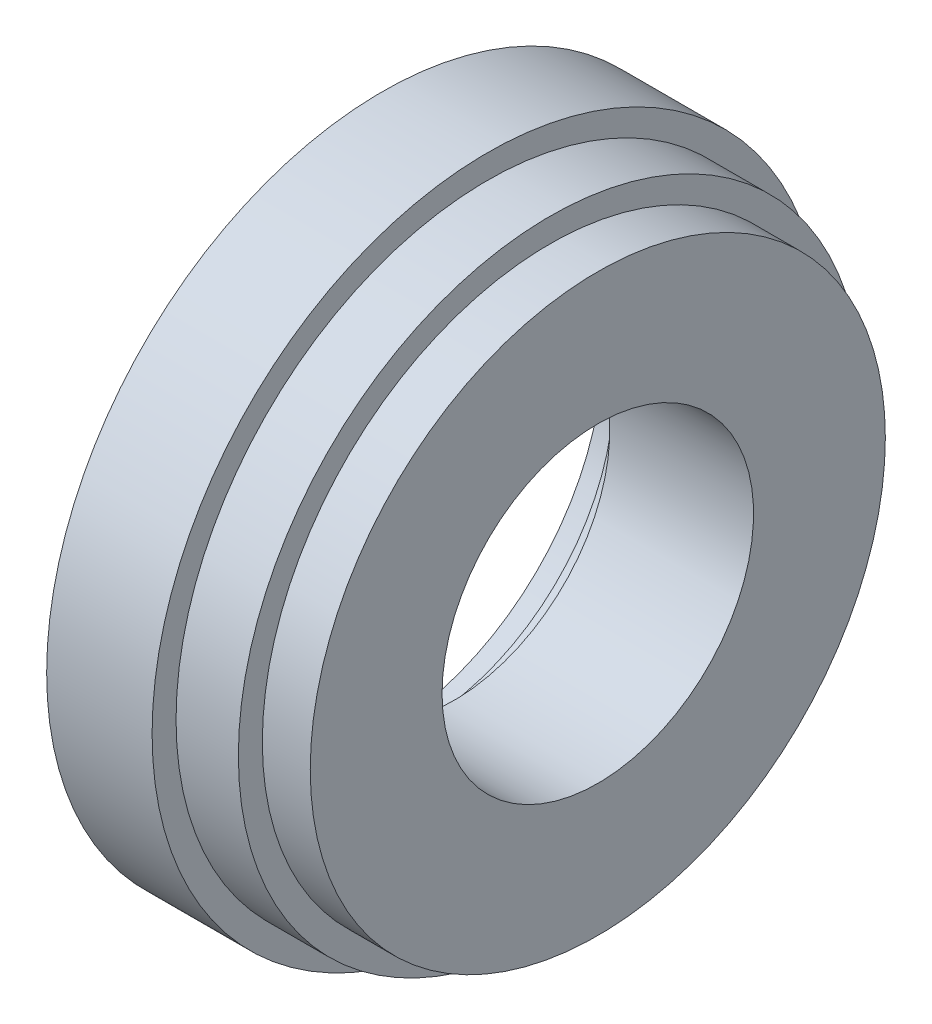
ISO-10303-21;
HEADER;
FILE_DESCRIPTION(('STEP AP214'),'2;1');
FILE_NAME('part.step','',(''),(''),'','','');
FILE_SCHEMA(('AUTOMOTIVE_DESIGN { 1 0 10303 214 1 1 1 1 }'));
ENDSEC;
DATA;
#1=APPLICATION_CONTEXT('core data for automotive mechanical design processes');
#2=APPLICATION_PROTOCOL_DEFINITION('international standard','automotive_design',2000,#1);
#3=PRODUCT_CONTEXT('',#1,'mechanical');
#4=PRODUCT('Part','Part','',(#3));
#5=PRODUCT_RELATED_PRODUCT_CATEGORY('part','',(#4));
#6=PRODUCT_DEFINITION_FORMATION('','',#4);
#7=PRODUCT_DEFINITION_CONTEXT('part definition',#1,'design');
#8=PRODUCT_DEFINITION('design','',#6,#7);
#9=PRODUCT_DEFINITION_SHAPE('','',#8);
#10=(LENGTH_UNIT() NAMED_UNIT(*) SI_UNIT(.MILLI.,.METRE.));
#11=(NAMED_UNIT(*) PLANE_ANGLE_UNIT() SI_UNIT($,.RADIAN.));
#12=(NAMED_UNIT(*) SI_UNIT($,.STERADIAN.) SOLID_ANGLE_UNIT());
#13=UNCERTAINTY_MEASURE_WITH_UNIT(LENGTH_MEASURE(1.E-05),#10,'distance_accuracy_value','');
#14=(GEOMETRIC_REPRESENTATION_CONTEXT(3) GLOBAL_UNCERTAINTY_ASSIGNED_CONTEXT((#13)) GLOBAL_UNIT_ASSIGNED_CONTEXT((#10,
#11,#12)) REPRESENTATION_CONTEXT('',''));
#15=CARTESIAN_POINT('',(0.,0.,0.));
#16=DIRECTION('',(0.,0.,1.));
#17=DIRECTION('',(1.,0.,0.));
#18=AXIS2_PLACEMENT_3D('',#15,#16,#17);
#19=CARTESIAN_POINT('',(-4.43492063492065,0.,0.));
#20=DIRECTION('',(-1.,0.,0.));
#21=DIRECTION('',(0.,0.,1.));
#22=AXIS2_PLACEMENT_3D('',#19,#20,#21);
#23=CYLINDRICAL_SURFACE('',#22,32.5);
#24=CARTESIAN_POINT('',(45.,0.,0.));
#25=DIRECTION('',(-1.,0.,0.));
#26=DIRECTION('',(0.,0.,1.));
#27=AXIS2_PLACEMENT_3D('',#24,#25,#26);
#28=CIRCLE('',#27,32.5);
#29=CARTESIAN_POINT('',(45.,0.,32.5));
#30=VERTEX_POINT('',#29);
#31=EDGE_CURVE('E69',#30,#30,#28,.T.);
#32=ORIENTED_EDGE('',*,*,#31,.F.);
#33=EDGE_LOOP('',(#32));
#34=FACE_BOUND('',#33,.T.);
#35=CARTESIAN_POINT('',(15.,0.,0.));
#36=DIRECTION('',(-1.,0.,0.));
#37=DIRECTION('',(0.,0.,1.));
#38=AXIS2_PLACEMENT_3D('',#35,#36,#37);
#39=CIRCLE('',#38,32.5);
#40=CARTESIAN_POINT('',(15.,0.,32.5));
#41=VERTEX_POINT('',#40);
#42=EDGE_CURVE('E10',#41,#41,#39,.T.);
#43=ORIENTED_EDGE('',*,*,#42,.T.);
#44=EDGE_LOOP('',(#43));
#45=FACE_BOUND('',#44,.T.);
#46=ADVANCED_FACE('F29',(#34,#45),#23,.F.);
#47=CARTESIAN_POINT('',(15.,40.,0.));
#48=DIRECTION('',(1.,0.,0.));
#49=DIRECTION('',(0.,0.,-1.));
#50=AXIS2_PLACEMENT_3D('',#47,#48,#49);
#51=PLANE('',#50);
#52=ORIENTED_EDGE('',*,*,#42,.F.);
#53=EDGE_LOOP('',(#52));
#54=FACE_BOUND('',#53,.T.);
#55=CARTESIAN_POINT('',(15.,0.,0.));
#56=DIRECTION('',(-1.,0.,0.));
#57=DIRECTION('',(0.,0.,1.));
#58=AXIS2_PLACEMENT_3D('',#55,#56,#57);
#59=CIRCLE('',#58,40.);
#60=CARTESIAN_POINT('',(15.,0.,40.));
#61=VERTEX_POINT('',#60);
#62=EDGE_CURVE('E35',#61,#61,#59,.T.);
#63=ORIENTED_EDGE('',*,*,#62,.T.);
#64=EDGE_LOOP('',(#63));
#65=FACE_BOUND('',#64,.T.);
#66=ADVANCED_FACE('F76',(#54,#65),#51,.F.);
#67=CARTESIAN_POINT('',(-4.43492063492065,0.,0.));
#68=DIRECTION('',(-1.,0.,0.));
#69=DIRECTION('',(0.,0.,1.));
#70=AXIS2_PLACEMENT_3D('',#67,#68,#69);
#71=CYLINDRICAL_SURFACE('',#70,40.);
#72=ORIENTED_EDGE('',*,*,#62,.F.);
#73=EDGE_LOOP('',(#72));
#74=FACE_BOUND('',#73,.T.);
#75=CARTESIAN_POINT('',(8.31547619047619,0.,0.));
#76=DIRECTION('',(-1.,0.,0.));
#77=DIRECTION('',(0.,0.,1.));
#78=AXIS2_PLACEMENT_3D('',#75,#76,#77);
#79=CIRCLE('',#78,40.);
#80=CARTESIAN_POINT('',(8.31547619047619,0.,40.));
#81=VERTEX_POINT('',#80);
#82=EDGE_CURVE('E39',#81,#81,#79,.T.);
#83=ORIENTED_EDGE('',*,*,#82,.T.);
#84=EDGE_LOOP('',(#83));
#85=FACE_BOUND('',#84,.T.);
#86=ADVANCED_FACE('F80',(#74,#85),#71,.F.);
#87=CARTESIAN_POINT('',(8.31547619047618,46.,0.));
#88=DIRECTION('',(1.,0.,0.));
#89=DIRECTION('',(0.,0.,-1.));
#90=AXIS2_PLACEMENT_3D('',#87,#88,#89);
#91=PLANE('',#90);
#92=ORIENTED_EDGE('',*,*,#82,.F.);
#93=EDGE_LOOP('',(#92));
#94=FACE_BOUND('',#93,.T.);
#95=CARTESIAN_POINT('',(8.31547619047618,0.,0.));
#96=DIRECTION('',(-1.,0.,0.));
#97=DIRECTION('',(0.,0.,1.));
#98=AXIS2_PLACEMENT_3D('',#95,#96,#97);
#99=CIRCLE('',#98,46.);
#100=CARTESIAN_POINT('',(8.31547619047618,0.,46.));
#101=VERTEX_POINT('',#100);
#102=EDGE_CURVE('E43',#101,#101,#99,.T.);
#103=ORIENTED_EDGE('',*,*,#102,.T.);
#104=EDGE_LOOP('',(#103));
#105=FACE_BOUND('',#104,.T.);
#106=ADVANCED_FACE('F85',(#94,#105),#91,.F.);
#107=CARTESIAN_POINT('',(-4.43492063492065,0.,0.));
#108=DIRECTION('',(-1.,0.,0.));
#109=DIRECTION('',(0.,0.,1.));
#110=AXIS2_PLACEMENT_3D('',#107,#108,#109);
#111=CYLINDRICAL_SURFACE('',#110,46.);
#112=ORIENTED_EDGE('',*,*,#102,.F.);
#113=EDGE_LOOP('',(#112));
#114=FACE_BOUND('',#113,.T.);
#115=CARTESIAN_POINT('',(0.,0.,0.));
#116=DIRECTION('',(-1.,0.,0.));
#117=DIRECTION('',(0.,0.,1.));
#118=AXIS2_PLACEMENT_3D('',#115,#116,#117);
#119=CIRCLE('',#118,46.);
#120=CARTESIAN_POINT('',(0.,0.,46.));
#121=VERTEX_POINT('',#120);
#122=EDGE_CURVE('E48',#121,#121,#119,.T.);
#123=ORIENTED_EDGE('',*,*,#122,.T.);
#124=EDGE_LOOP('',(#123));
#125=FACE_BOUND('',#124,.T.);
#126=ADVANCED_FACE('F91',(#114,#125),#111,.F.);
#127=CARTESIAN_POINT('',(0.,46.,0.));
#128=DIRECTION('',(1.,0.,0.));
#129=DIRECTION('',(0.,0.,-1.));
#130=AXIS2_PLACEMENT_3D('',#127,#128,#129);
#131=PLANE('',#130);
#132=ORIENTED_EDGE('',*,*,#122,.F.);
#133=EDGE_LOOP('',(#132));
#134=FACE_BOUND('',#133,.T.);
#135=CARTESIAN_POINT('',(0.,0.,0.));
#136=DIRECTION('',(-1.,0.,0.));
#137=DIRECTION('',(0.,0.,1.));
#138=AXIS2_PLACEMENT_3D('',#135,#136,#137);
#139=CIRCLE('',#138,70.);
#140=CARTESIAN_POINT('',(0.,0.,70.));
#141=VERTEX_POINT('',#140);
#142=EDGE_CURVE('E51',#141,#141,#139,.T.);
#143=ORIENTED_EDGE('',*,*,#142,.T.);
#144=EDGE_LOOP('',(#143));
#145=FACE_BOUND('',#144,.T.);
#146=ADVANCED_FACE('F95',(#134,#145),#131,.F.);
#147=CARTESIAN_POINT('',(-4.43492063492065,0.,0.));
#148=DIRECTION('',(-1.,0.,0.));
#149=DIRECTION('',(0.,0.,1.));
#150=AXIS2_PLACEMENT_3D('',#147,#148,#149);
#151=CYLINDRICAL_SURFACE('',#150,70.);
#152=ORIENTED_EDGE('',*,*,#142,.F.);
#153=EDGE_LOOP('',(#152));
#154=FACE_BOUND('',#153,.T.);
#155=CARTESIAN_POINT('',(22.,0.,0.));
#156=DIRECTION('',(-1.,0.,0.));
#157=DIRECTION('',(0.,0.,1.));
#158=AXIS2_PLACEMENT_3D('',#155,#156,#157);
#159=CIRCLE('',#158,70.);
#160=CARTESIAN_POINT('',(22.,0.,70.));
#161=VERTEX_POINT('',#160);
#162=EDGE_CURVE('E54',#161,#161,#159,.T.);
#163=ORIENTED_EDGE('',*,*,#162,.T.);
#164=EDGE_LOOP('',(#163));
#165=FACE_BOUND('',#164,.T.);
#166=ADVANCED_FACE('F99',(#154,#165),#151,.T.);
#167=CARTESIAN_POINT('',(22.,70.,0.));
#168=DIRECTION('',(-1.,0.,0.));
#169=DIRECTION('',(0.,0.,1.));
#170=AXIS2_PLACEMENT_3D('',#167,#168,#169);
#171=PLANE('',#170);
#172=ORIENTED_EDGE('',*,*,#162,.F.);
#173=EDGE_LOOP('',(#172));
#174=FACE_BOUND('',#173,.T.);
#175=CARTESIAN_POINT('',(22.,0.,0.));
#176=DIRECTION('',(-1.,0.,0.));
#177=DIRECTION('',(0.,0.,1.));
#178=AXIS2_PLACEMENT_3D('',#175,#176,#177);
#179=CIRCLE('',#178,65.);
#180=CARTESIAN_POINT('',(22.,0.,65.));
#181=VERTEX_POINT('',#180);
#182=EDGE_CURVE('E57',#181,#181,#179,.T.);
#183=ORIENTED_EDGE('',*,*,#182,.T.);
#184=EDGE_LOOP('',(#183));
#185=FACE_BOUND('',#184,.T.);
#186=ADVANCED_FACE('F103',(#174,#185),#171,.F.);
#187=CARTESIAN_POINT('',(-4.43492063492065,0.,0.));
#188=DIRECTION('',(-1.,0.,0.));
#189=DIRECTION('',(0.,0.,1.));
#190=AXIS2_PLACEMENT_3D('',#187,#188,#189);
#191=CYLINDRICAL_SURFACE('',#190,65.);
#192=ORIENTED_EDGE('',*,*,#182,.F.);
#193=EDGE_LOOP('',(#192));
#194=FACE_BOUND('',#193,.T.);
#195=CARTESIAN_POINT('',(35.,0.,0.));
#196=DIRECTION('',(-1.,0.,0.));
#197=DIRECTION('',(0.,0.,1.));
#198=AXIS2_PLACEMENT_3D('',#195,#196,#197);
#199=CIRCLE('',#198,65.);
#200=CARTESIAN_POINT('',(35.,0.,65.));
#201=VERTEX_POINT('',#200);
#202=EDGE_CURVE('E60',#201,#201,#199,.T.);
#203=ORIENTED_EDGE('',*,*,#202,.T.);
#204=EDGE_LOOP('',(#203));
#205=FACE_BOUND('',#204,.T.);
#206=ADVANCED_FACE('F107',(#194,#205),#191,.T.);
#207=CARTESIAN_POINT('',(35.,60.,0.));
#208=DIRECTION('',(-1.,0.,0.));
#209=DIRECTION('',(0.,0.,1.));
#210=AXIS2_PLACEMENT_3D('',#207,#208,#209);
#211=PLANE('',#210);
#212=ORIENTED_EDGE('',*,*,#202,.F.);
#213=EDGE_LOOP('',(#212));
#214=FACE_BOUND('',#213,.T.);
#215=CARTESIAN_POINT('',(35.,0.,0.));
#216=DIRECTION('',(-1.,0.,0.));
#217=DIRECTION('',(0.,0.,1.));
#218=AXIS2_PLACEMENT_3D('',#215,#216,#217);
#219=CIRCLE('',#218,60.);
#220=CARTESIAN_POINT('',(35.,0.,60.));
#221=VERTEX_POINT('',#220);
#222=EDGE_CURVE('E63',#221,#221,#219,.T.);
#223=ORIENTED_EDGE('',*,*,#222,.T.);
#224=EDGE_LOOP('',(#223));
#225=FACE_BOUND('',#224,.T.);
#226=ADVANCED_FACE('F111',(#214,#225),#211,.F.);
#227=CARTESIAN_POINT('',(-4.43492063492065,0.,0.));
#228=DIRECTION('',(-1.,0.,0.));
#229=DIRECTION('',(0.,0.,1.));
#230=AXIS2_PLACEMENT_3D('',#227,#228,#229);
#231=CYLINDRICAL_SURFACE('',#230,60.);
#232=ORIENTED_EDGE('',*,*,#222,.F.);
#233=EDGE_LOOP('',(#232));
#234=FACE_BOUND('',#233,.T.);
#235=CARTESIAN_POINT('',(45.,0.,0.));
#236=DIRECTION('',(-1.,0.,0.));
#237=DIRECTION('',(0.,0.,1.));
#238=AXIS2_PLACEMENT_3D('',#235,#236,#237);
#239=CIRCLE('',#238,60.);
#240=CARTESIAN_POINT('',(45.,0.,60.));
#241=VERTEX_POINT('',#240);
#242=EDGE_CURVE('E66',#241,#241,#239,.T.);
#243=ORIENTED_EDGE('',*,*,#242,.T.);
#244=EDGE_LOOP('',(#243));
#245=FACE_BOUND('',#244,.T.);
#246=ADVANCED_FACE('F115',(#234,#245),#231,.T.);
#247=CARTESIAN_POINT('',(45.,60.,0.));
#248=DIRECTION('',(-1.,0.,0.));
#249=DIRECTION('',(0.,0.,1.));
#250=AXIS2_PLACEMENT_3D('',#247,#248,#249);
#251=PLANE('',#250);
#252=ORIENTED_EDGE('',*,*,#242,.F.);
#253=EDGE_LOOP('',(#252));
#254=FACE_BOUND('',#253,.T.);
#255=ORIENTED_EDGE('',*,*,#31,.T.);
#256=EDGE_LOOP('',(#255));
#257=FACE_BOUND('',#256,.T.);
#258=ADVANCED_FACE('F73',(#254,#257),#251,.F.);
#259=CLOSED_SHELL('',(#46,#66,#86,#106,#126,#146,#166,#186,#206,#226,#246,#258));
#260=MANIFOLD_SOLID_BREP('B2',#259);
#261=ADVANCED_BREP_SHAPE_REPRESENTATION('',(#18,#260),#14);
#262=SHAPE_DEFINITION_REPRESENTATION(#9,#261);
ENDSEC;
END-ISO-10303-21;
